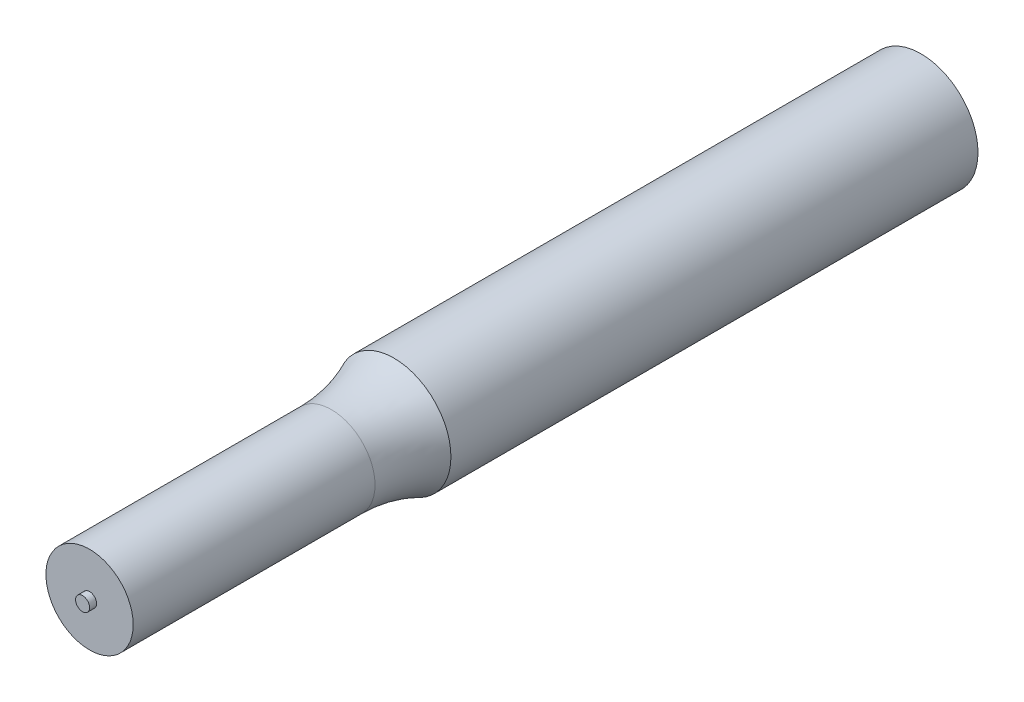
from build123d import *

# Parameters (mm, degrees)
LOGO3_BIB4_W = 0.5842
LOGO3_BIB4_H = 1.1684


with BuildPart() as part:
    # logo3_bib2 → Revolve2_Shoulder (revolve)
    with BuildSketch(Plane(origin=(0, 0, 0), x_dir=(1, 0, 0), z_dir=(0, 1, 0)), mode=Mode.PRIVATE) as revolve2_shoulder_sk:
        with BuildLine():
            Line((-4.7625, -6.35), (0, -6.35))
            Line((0, -6.35), (0, -75.74153))
            Line((0, -75.74153), (-3.64236, -75.74153))
            Line((-3.64236, -75.74153), (-3.64236, -55.556589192))
            ThreePointArc((-3.64236, -55.556589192), (-3.925552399, -52.889589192), (-4.7625, -50.34153))
            Line((-4.7625, -50.34153), (-4.7625, -6.35))
        make_face()
    revolve(revolve2_shoulder_sk.sketch.rotate(Axis((0, 0, 43.517168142), (0, 0, -1)), 180), axis=Axis((0, 0, 43.517168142), (0, 0, -1)))

    # logo3_bib4 → Revolve2_Shoulder_JT (revolve)
    with BuildSketch(Plane(origin=(0, 0, 0), x_dir=(1, 0, 0), z_dir=(0, 1, 0))):
        with Locations((-0.2921, -75.74153)):
            Rectangle(LOGO3_BIB4_W, LOGO3_BIB4_H)
    revolve(axis=Axis((0, 0, 0), (0, 0, 1)))

    # Sketch1_2 → Cut-Revolve_Ball_Shoulder (revolve, cut)
    with BuildSketch(Plane(origin=(0, 0, 0), x_dir=(1, 0, 0), z_dir=(0, 1, 0))):
        with BuildLine():
            Line((-9.607314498, -22.514499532), (-6.5405, -11.068992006))
            Line((-6.5405, -11.068992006), (-6.5405, -26.51125))
            ThreePointArc((-6.5405, -26.51125), (-9.059396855, -25.269067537), (-9.607314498, -22.514499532))
        make_face()
    revolve(axis=Axis((-6.5405, 0, 12.118432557), (0, 0, 1)), mode=Mode.SUBTRACT)


solid = part.part
